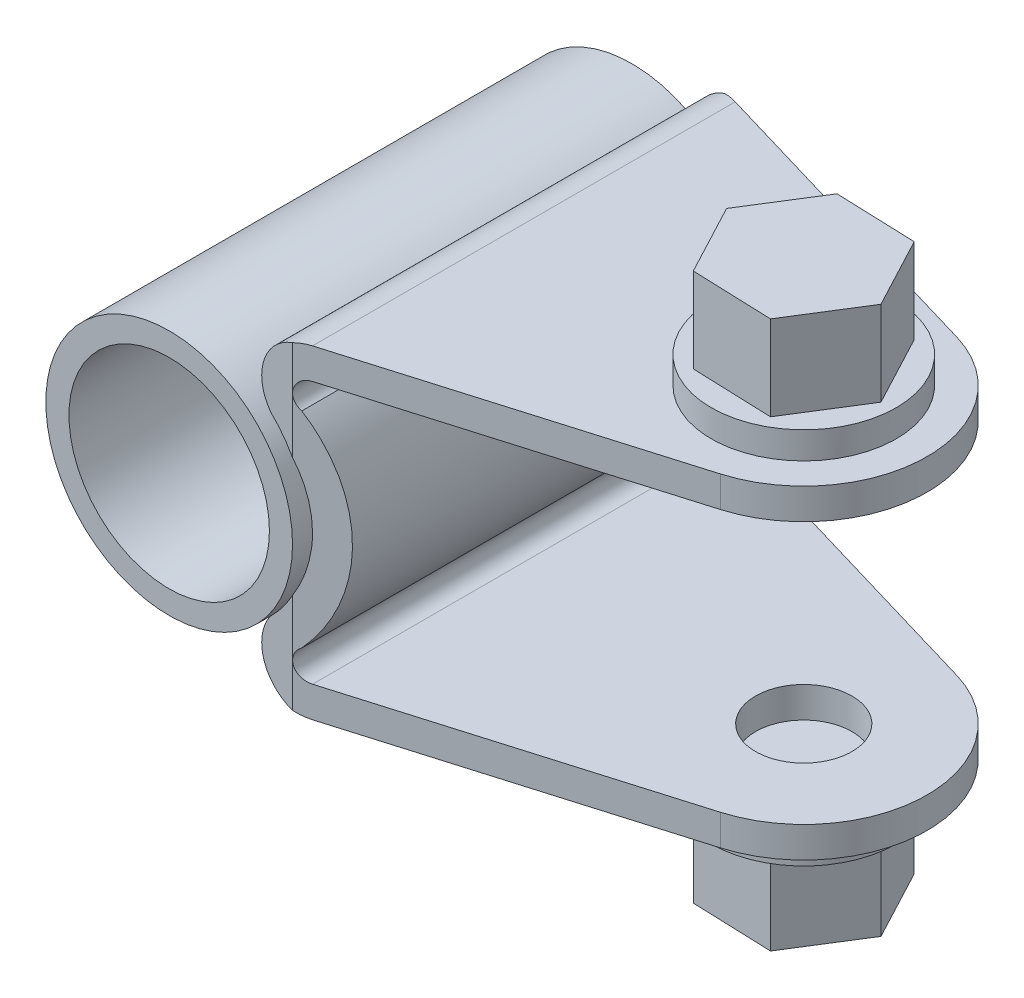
ISO-10303-21;
HEADER;
FILE_DESCRIPTION(('STEP AP214'),'2;1');
FILE_NAME('part.step','',(''),(''),'','','');
FILE_SCHEMA(('AUTOMOTIVE_DESIGN { 1 0 10303 214 1 1 1 1 }'));
ENDSEC;
DATA;
#1=APPLICATION_CONTEXT('core data for automotive mechanical design processes');
#2=APPLICATION_PROTOCOL_DEFINITION('international standard','automotive_design',2000,#1);
#3=PRODUCT_CONTEXT('',#1,'mechanical');
#4=PRODUCT('Part','Part','',(#3));
#5=PRODUCT_RELATED_PRODUCT_CATEGORY('part','',(#4));
#6=PRODUCT_DEFINITION_FORMATION('','',#4);
#7=PRODUCT_DEFINITION_CONTEXT('part definition',#1,'design');
#8=PRODUCT_DEFINITION('design','',#6,#7);
#9=PRODUCT_DEFINITION_SHAPE('','',#8);
#10=(LENGTH_UNIT() NAMED_UNIT(*) SI_UNIT(.MILLI.,.METRE.));
#11=(NAMED_UNIT(*) PLANE_ANGLE_UNIT() SI_UNIT($,.RADIAN.));
#12=(NAMED_UNIT(*) SI_UNIT($,.STERADIAN.) SOLID_ANGLE_UNIT());
#13=UNCERTAINTY_MEASURE_WITH_UNIT(LENGTH_MEASURE(1.E-05),#10,'distance_accuracy_value','');
#14=(GEOMETRIC_REPRESENTATION_CONTEXT(3) GLOBAL_UNCERTAINTY_ASSIGNED_CONTEXT((#13)) GLOBAL_UNIT_ASSIGNED_CONTEXT((#10,
#11,#12)) REPRESENTATION_CONTEXT('',''));
#15=CARTESIAN_POINT('',(0.,0.,0.));
#16=DIRECTION('',(0.,0.,1.));
#17=DIRECTION('',(1.,0.,0.));
#18=AXIS2_PLACEMENT_3D('',#15,#16,#17);
#19=CARTESIAN_POINT('',(16055.3670907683,-4383.99790931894,0.));
#20=DIRECTION('',(0.,-1.,0.));
#21=DIRECTION('',(1.,0.,0.));
#22=AXIS2_PLACEMENT_3D('',#19,#20,#21);
#23=PLANE('',#22);
#24=CARTESIAN_POINT('',(16055.3670907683,-4383.99790931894,0.));
#25=DIRECTION('',(0.,-1.,0.));
#26=DIRECTION('',(1.,0.,0.));
#27=AXIS2_PLACEMENT_3D('',#24,#25,#26);
#28=CIRCLE('',#27,12.0000000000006);
#29=CARTESIAN_POINT('',(16067.3670907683,-4383.99790931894,0.));
#30=VERTEX_POINT('',#29);
#31=EDGE_CURVE('E225',#30,#30,#28,.T.);
#32=ORIENTED_EDGE('',*,*,#31,.T.);
#33=EDGE_LOOP('',(#32));
#34=FACE_BOUND('',#33,.T.);
#35=DIRECTION('',(0.46827475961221,0.,0.883582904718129));
#36=VECTOR('',#35,1.);
#37=CARTESIAN_POINT('',(16060.8861098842,-4383.99790931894,-8.80570428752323));
#38=LINE('',#37,#36);
#39=CARTESIAN_POINT('',(16060.8861098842,-4383.99790931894,-8.80570428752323));
#40=VERTEX_POINT('',#39);
#41=CARTESIAN_POINT('',(16065.7525639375,-4383.99790931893,0.376758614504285));
#42=VERTEX_POINT('',#41);
#43=EDGE_CURVE('E219',#40,#42,#38,.T.);
#44=ORIENTED_EDGE('',*,*,#43,.F.);
#45=DIRECTION('',(0.99934262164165,0.,0.0362536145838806));
#46=VECTOR('',#45,1.);
#47=CARTESIAN_POINT('',(16050.5006367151,-4383.99790931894,-9.18246290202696));
#48=LINE('',#47,#46);
#49=CARTESIAN_POINT('',(16050.5006367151,-4383.99790931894,-9.18246290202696));
#50=VERTEX_POINT('',#49);
#51=EDGE_CURVE('E230',#50,#40,#48,.T.);
#52=ORIENTED_EDGE('',*,*,#51,.F.);
#53=DIRECTION('',(0.531067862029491,0.,-0.847329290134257));
#54=VECTOR('',#53,1.);
#55=CARTESIAN_POINT('',(16044.9816175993,-4383.99790931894,-0.376758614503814));
#56=LINE('',#55,#54);
#57=CARTESIAN_POINT('',(16044.9816175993,-4383.99790931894,-0.376758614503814));
#58=VERTEX_POINT('',#57);
#59=EDGE_CURVE('E247',#58,#50,#56,.T.);
#60=ORIENTED_EDGE('',*,*,#59,.F.);
#61=DIRECTION('',(-0.468274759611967,0.,-0.883582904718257));
#62=VECTOR('',#61,1.);
#63=CARTESIAN_POINT('',(16049.8480716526,-4383.99790931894,8.80570428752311));
#64=LINE('',#63,#62);
#65=CARTESIAN_POINT('',(16049.8480716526,-4383.99790931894,8.80570428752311));
#66=VERTEX_POINT('',#65);
#67=EDGE_CURVE('E245',#66,#58,#64,.T.);
#68=ORIENTED_EDGE('',*,*,#67,.F.);
#69=DIRECTION('',(-0.99934262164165,0.,-0.0362536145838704));
#70=VECTOR('',#69,1.);
#71=CARTESIAN_POINT('',(16060.2335448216,-4383.99790931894,9.18246290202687));
#72=LINE('',#71,#70);
#73=CARTESIAN_POINT('',(16060.2335448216,-4383.99790931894,9.18246290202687));
#74=VERTEX_POINT('',#73);
#75=EDGE_CURVE('E241',#74,#66,#72,.T.);
#76=ORIENTED_EDGE('',*,*,#75,.F.);
#77=DIRECTION('',(-0.531067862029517,0.,0.847329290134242));
#78=VECTOR('',#77,1.);
#79=CARTESIAN_POINT('',(16065.7525639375,-4383.99790931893,0.376758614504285));
#80=LINE('',#79,#78);
#81=EDGE_CURVE('E239',#42,#74,#80,.T.);
#82=ORIENTED_EDGE('',*,*,#81,.F.);
#83=EDGE_LOOP('',(#44,#52,#60,#68,#76,#82));
#84=FACE_BOUND('',#83,.T.);
#85=ADVANCED_FACE('F16',(#34,#84),#23,.T.);
#86=CARTESIAN_POINT('',(16019.0670907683,-4380.49790931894,30.));
#87=DIRECTION('',(0.,1.,0.));
#88=DIRECTION('',(-1.,0.,0.));
#89=AXIS2_PLACEMENT_3D('',#86,#87,#88);
#90=PLANE('',#89);
#91=DIRECTION('',(-0.959015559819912,0.,-0.283353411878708));
#92=VECTOR('',#91,1.);
#93=CARTESIAN_POINT('',(16034.6674516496,-4380.49790931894,-22.7997482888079));
#94=LINE('',#93,#92);
#95=CARTESIAN_POINT('',(16059.9007453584,-4380.49790931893,-15.3442489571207));
#96=VERTEX_POINT('',#95);
#97=CARTESIAN_POINT('',(16019.0670907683,-4380.49790931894,-27.4090744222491));
#98=VERTEX_POINT('',#97);
#99=EDGE_CURVE('E400',#96,#98,#94,.T.);
#100=ORIENTED_EDGE('',*,*,#99,.F.);
#101=CARTESIAN_POINT('',(16055.3670907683,-4380.49790931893,0.));
#102=DIRECTION('',(0.,1.,0.));
#103=DIRECTION('',(-1.,0.,0.));
#104=AXIS2_PLACEMENT_3D('',#101,#102,#103);
#105=CIRCLE('',#104,16.0000000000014);
#106=CARTESIAN_POINT('',(16059.9007453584,-4380.49790931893,15.34424895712));
#107=VERTEX_POINT('',#106);
#108=EDGE_CURVE('E417',#107,#96,#105,.T.);
#109=ORIENTED_EDGE('',*,*,#108,.F.);
#110=DIRECTION('',(0.959015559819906,0.,-0.283353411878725));
#111=VECTOR('',#110,1.);
#112=CARTESIAN_POINT('',(16018.3630317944,-4380.49790931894,27.6170976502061));
#113=LINE('',#112,#111);
#114=CARTESIAN_POINT('',(16019.0670907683,-4380.49790931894,27.4090744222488));
#115=VERTEX_POINT('',#114);
#116=EDGE_CURVE('E384',#115,#107,#113,.T.);
#117=ORIENTED_EDGE('',*,*,#116,.F.);
#118=DIRECTION('',(0.,0.,-1.));
#119=VECTOR('',#118,1.);
#120=CARTESIAN_POINT('',(16019.0670907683,-4380.49790931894,30.));
#121=LINE('',#120,#119);
#122=EDGE_CURVE('E434',#115,#98,#121,.T.);
#123=ORIENTED_EDGE('',*,*,#122,.T.);
#124=EDGE_LOOP('',(#100,#109,#117,#123));
#125=FACE_BOUND('',#124,.T.);
#126=CARTESIAN_POINT('',(16055.3670907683,-4380.49790931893,0.));
#127=DIRECTION('',(0.,1.,0.));
#128=DIRECTION('',(-1.,0.,0.));
#129=AXIS2_PLACEMENT_3D('',#126,#127,#128);
#130=CIRCLE('',#129,12.0000000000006);
#131=CARTESIAN_POINT('',(16043.3670907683,-4380.49790931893,0.));
#132=VERTEX_POINT('',#131);
#133=EDGE_CURVE('E11',#132,#132,#130,.F.);
#134=ORIENTED_EDGE('',*,*,#133,.F.);
#135=EDGE_LOOP('',(#134));
#136=FACE_BOUND('',#135,.T.);
#137=ADVANCED_FACE('F477',(#125,#136),#90,.F.);
#138=CARTESIAN_POINT('',(16055.3670907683,-4334.99790931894,0.));
#139=DIRECTION('',(0.,1.,0.));
#140=DIRECTION('',(0.,0.,1.));
#141=AXIS2_PLACEMENT_3D('',#138,#139,#140);
#142=PLANE('',#141);
#143=CARTESIAN_POINT('',(16055.3670907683,-4334.99790931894,0.));
#144=DIRECTION('',(0.,1.,0.));
#145=DIRECTION('',(0.,0.,1.));
#146=AXIS2_PLACEMENT_3D('',#143,#144,#145);
#147=CIRCLE('',#146,12.0000000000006);
#148=CARTESIAN_POINT('',(16055.3670907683,-4334.99790931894,12.0000000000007));
#149=VERTEX_POINT('',#148);
#150=EDGE_CURVE('E312',#149,#149,#147,.T.);
#151=ORIENTED_EDGE('',*,*,#150,.T.);
#152=EDGE_LOOP('',(#151));
#153=FACE_BOUND('',#152,.T.);
#154=DIRECTION('',(-0.531067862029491,0.,0.847329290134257));
#155=VECTOR('',#154,1.);
#156=CARTESIAN_POINT('',(16050.5006367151,-4334.99790931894,-9.18246290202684));
#157=LINE('',#156,#155);
#158=CARTESIAN_POINT('',(16050.5006367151,-4334.99790931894,-9.18246290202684));
#159=VERTEX_POINT('',#158);
#160=CARTESIAN_POINT('',(16044.9816175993,-4334.99790931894,-0.376758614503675));
#161=VERTEX_POINT('',#160);
#162=EDGE_CURVE('E274',#159,#161,#157,.T.);
#163=ORIENTED_EDGE('',*,*,#162,.F.);
#164=DIRECTION('',(-0.99934262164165,0.,-0.0362536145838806));
#165=VECTOR('',#164,1.);
#166=CARTESIAN_POINT('',(16060.8861098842,-4334.99790931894,-8.80570428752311));
#167=LINE('',#166,#165);
#168=CARTESIAN_POINT('',(16060.8861098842,-4334.99790931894,-8.80570428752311));
#169=VERTEX_POINT('',#168);
#170=EDGE_CURVE('E271',#169,#159,#167,.T.);
#171=ORIENTED_EDGE('',*,*,#170,.F.);
#172=DIRECTION('',(-0.46827475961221,0.,-0.883582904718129));
#173=VECTOR('',#172,1.);
#174=CARTESIAN_POINT('',(16065.7525639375,-4334.99790931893,0.376758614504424));
#175=LINE('',#174,#173);
#176=CARTESIAN_POINT('',(16065.7525639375,-4334.99790931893,0.376758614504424));
#177=VERTEX_POINT('',#176);
#178=EDGE_CURVE('E282',#177,#169,#175,.T.);
#179=ORIENTED_EDGE('',*,*,#178,.F.);
#180=DIRECTION('',(0.531067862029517,0.,-0.847329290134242));
#181=VECTOR('',#180,1.);
#182=CARTESIAN_POINT('',(16060.2335448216,-4334.99790931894,9.18246290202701));
#183=LINE('',#182,#181);
#184=CARTESIAN_POINT('',(16060.2335448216,-4334.99790931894,9.18246290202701));
#185=VERTEX_POINT('',#184);
#186=EDGE_CURVE('E280',#185,#177,#183,.T.);
#187=ORIENTED_EDGE('',*,*,#186,.F.);
#188=DIRECTION('',(0.99934262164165,0.,0.0362536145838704));
#189=VECTOR('',#188,1.);
#190=CARTESIAN_POINT('',(16049.8480716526,-4334.99790931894,8.80570428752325));
#191=LINE('',#190,#189);
#192=CARTESIAN_POINT('',(16049.8480716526,-4334.99790931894,8.80570428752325));
#193=VERTEX_POINT('',#192);
#194=EDGE_CURVE('E278',#193,#185,#191,.T.);
#195=ORIENTED_EDGE('',*,*,#194,.F.);
#196=DIRECTION('',(0.468274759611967,0.,0.883582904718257));
#197=VECTOR('',#196,1.);
#198=CARTESIAN_POINT('',(16044.9816175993,-4334.99790931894,-0.376758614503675));
#199=LINE('',#198,#197);
#200=EDGE_CURVE('E276',#161,#193,#199,.T.);
#201=ORIENTED_EDGE('',*,*,#200,.F.);
#202=EDGE_LOOP('',(#163,#171,#179,#187,#195,#201));
#203=FACE_BOUND('',#202,.T.);
#204=ADVANCED_FACE('F466',(#153,#203),#142,.T.);
#205=CARTESIAN_POINT('',(16071.3670907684,-4338.49790931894,30.));
#206=DIRECTION('',(0.,-1.,0.));
#207=DIRECTION('',(0.,0.,-1.));
#208=AXIS2_PLACEMENT_3D('',#205,#206,#207);
#209=PLANE('',#208);
#210=DIRECTION('',(-0.959015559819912,0.,-0.283353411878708));
#211=VECTOR('',#210,1.);
#212=CARTESIAN_POINT('',(16017.0670907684,-4338.49790931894,-27.9999999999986));
#213=LINE('',#212,#211);
#214=CARTESIAN_POINT('',(16059.9007453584,-4338.49790931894,-15.3442489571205));
#215=VERTEX_POINT('',#214);
#216=CARTESIAN_POINT('',(16019.0670907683,-4338.49790931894,-27.4090744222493));
#217=VERTEX_POINT('',#216);
#218=EDGE_CURVE('E354',#215,#217,#213,.T.);
#219=ORIENTED_EDGE('',*,*,#218,.T.);
#220=DIRECTION('',(0.,0.,-1.));
#221=VECTOR('',#220,1.);
#222=CARTESIAN_POINT('',(16019.0670907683,-4338.49790931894,30.));
#223=LINE('',#222,#221);
#224=CARTESIAN_POINT('',(16019.0670907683,-4338.49790931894,27.4090744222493));
#225=VERTEX_POINT('',#224);
#226=EDGE_CURVE('E437',#225,#217,#223,.T.);
#227=ORIENTED_EDGE('',*,*,#226,.F.);
#228=DIRECTION('',(0.959015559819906,0.,-0.283353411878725));
#229=VECTOR('',#228,1.);
#230=CARTESIAN_POINT('',(16017.0670907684,-4338.49790931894,27.9999999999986));
#231=LINE('',#230,#229);
#232=CARTESIAN_POINT('',(16059.9007453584,-4338.49790931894,15.3442489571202));
#233=VERTEX_POINT('',#232);
#234=EDGE_CURVE('E349',#225,#233,#231,.T.);
#235=ORIENTED_EDGE('',*,*,#234,.T.);
#236=CARTESIAN_POINT('',(16055.3670907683,-4338.49790931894,0.));
#237=DIRECTION('',(0.,1.,0.));
#238=DIRECTION('',(0.,0.,1.));
#239=AXIS2_PLACEMENT_3D('',#236,#237,#238);
#240=CIRCLE('',#239,16.0000000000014);
#241=EDGE_CURVE('E352',#233,#215,#240,.T.);
#242=ORIENTED_EDGE('',*,*,#241,.T.);
#243=EDGE_LOOP('',(#219,#227,#235,#242));
#244=FACE_BOUND('',#243,.T.);
#245=CARTESIAN_POINT('',(16055.3670907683,-4338.49790931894,0.));
#246=DIRECTION('',(0.,-1.,0.));
#247=DIRECTION('',(0.,0.,-1.));
#248=AXIS2_PLACEMENT_3D('',#245,#246,#247);
#249=CIRCLE('',#248,12.0000000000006);
#250=CARTESIAN_POINT('',(16055.3670907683,-4338.49790931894,-12.0000000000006));
#251=VERTEX_POINT('',#250);
#252=EDGE_CURVE('E24',#251,#251,#249,.F.);
#253=ORIENTED_EDGE('',*,*,#252,.F.);
#254=EDGE_LOOP('',(#253));
#255=FACE_BOUND('',#254,.T.);
#256=ADVANCED_FACE('F463',(#244,#255),#209,.F.);
#257=CARTESIAN_POINT('',(16019.0670907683,-4344.49790931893,30.));
#258=DIRECTION('',(0.,0.,-1.));
#259=DIRECTION('',(-1.,0.,0.));
#260=AXIS2_PLACEMENT_3D('',#257,#258,#259);
#261=CYLINDRICAL_SURFACE('',#260,6.);
#262=DIRECTION('',(0.,0.,-1.));
#263=VECTOR('',#262,1.);
#264=CARTESIAN_POINT('',(16014.1989782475,-4348.00525596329,0.));
#265=LINE('',#264,#263);
#266=CARTESIAN_POINT('',(16014.1989782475,-4348.00525596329,27.9999999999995));
#267=VERTEX_POINT('',#266);
#268=CARTESIAN_POINT('',(16014.1989782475,-4348.00525596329,-27.9999999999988));
#269=VERTEX_POINT('',#268);
#270=EDGE_CURVE('E338',#267,#269,#265,.T.);
#271=ORIENTED_EDGE('',*,*,#270,.F.);
#272=CARTESIAN_POINT('',(16019.0670907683,-4344.49790931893,27.9999999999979));
#273=DIRECTION('',(3.38271077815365E-13,0.,1.));
#274=DIRECTION('',(1.,0.,-3.38271077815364E-13));
#275=AXIS2_PLACEMENT_3D('',#272,#273,#274);
#276=CIRCLE('',#275,6.);
#277=CARTESIAN_POINT('',(16017.0670907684,-4338.84105506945,27.9999999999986));
#278=VERTEX_POINT('',#277);
#279=EDGE_CURVE('E414',#278,#267,#276,.T.);
#280=ORIENTED_EDGE('',*,*,#279,.F.);
#281=CARTESIAN_POINT('',(16019.0670907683,-4344.49790931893,27.4090744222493));
#282=DIRECTION('',(0.283353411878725,0.,0.959015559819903));
#283=DIRECTION('',(0.959015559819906,0.,-0.283353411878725));
#284=AXIS2_PLACEMENT_3D('',#281,#282,#283);
#285=ELLIPSE('',#284,6.25641569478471,6.);
#286=EDGE_CURVE('E388',#225,#278,#285,.T.);
#287=ORIENTED_EDGE('',*,*,#286,.F.);
#288=ORIENTED_EDGE('',*,*,#226,.T.);
#289=CARTESIAN_POINT('',(16019.0670907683,-4344.49790931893,-27.4090744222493));
#290=DIRECTION('',(0.283353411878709,0.,-0.959015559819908));
#291=DIRECTION('',(-0.959015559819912,0.,-0.283353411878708));
#292=AXIS2_PLACEMENT_3D('',#289,#290,#291);
#293=ELLIPSE('',#292,6.25641569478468,6.);
#294=CARTESIAN_POINT('',(16017.0670907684,-4338.84105506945,-27.9999999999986));
#295=VERTEX_POINT('',#294);
#296=EDGE_CURVE('E405',#295,#217,#293,.T.);
#297=ORIENTED_EDGE('',*,*,#296,.F.);
#298=CARTESIAN_POINT('',(16019.0670907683,-4344.49790931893,-27.9999999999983));
#299=DIRECTION('',(1.0581813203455E-13,0.,-1.));
#300=DIRECTION('',(-1.,0.,-1.0581813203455E-13));
#301=AXIS2_PLACEMENT_3D('',#298,#299,#300);
#302=CIRCLE('',#301,6.);
#303=EDGE_CURVE('E410',#269,#295,#302,.T.);
#304=ORIENTED_EDGE('',*,*,#303,.F.);
#305=EDGE_LOOP('',(#271,#280,#287,#288,#297,#304));
#306=FACE_BOUND('',#305,.T.);
#307=ADVANCED_FACE('F465',(#306),#261,.T.);
#308=CARTESIAN_POINT('',(16019.0670907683,-4374.49790931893,30.));
#309=DIRECTION('',(0.,0.,-1.));
#310=DIRECTION('',(-1.,0.,0.));
#311=AXIS2_PLACEMENT_3D('',#308,#309,#310);
#312=CYLINDRICAL_SURFACE('',#311,6.);
#313=DIRECTION('',(0.,0.,-1.));
#314=VECTOR('',#313,1.);
#315=CARTESIAN_POINT('',(16014.1989782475,-4370.99056267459,0.));
#316=LINE('',#315,#314);
#317=CARTESIAN_POINT('',(16014.1989782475,-4370.99056267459,-27.9999999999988));
#318=VERTEX_POINT('',#317);
#319=CARTESIAN_POINT('',(16014.1989782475,-4370.99056267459,27.9999999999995));
#320=VERTEX_POINT('',#319);
#321=EDGE_CURVE('E336',#318,#320,#316,.F.);
#322=ORIENTED_EDGE('',*,*,#321,.F.);
#323=CARTESIAN_POINT('',(16019.0670907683,-4374.49790931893,-27.9999999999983));
#324=DIRECTION('',(1.0581813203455E-13,0.,-1.));
#325=DIRECTION('',(-1.,0.,-1.0581813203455E-13));
#326=AXIS2_PLACEMENT_3D('',#323,#324,#325);
#327=CIRCLE('',#326,6.);
#328=CARTESIAN_POINT('',(16017.0670907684,-4380.15476356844,-27.9999999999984));
#329=VERTEX_POINT('',#328);
#330=EDGE_CURVE('E407',#329,#318,#327,.T.);
#331=ORIENTED_EDGE('',*,*,#330,.F.);
#332=CARTESIAN_POINT('',(16019.0670907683,-4374.49790931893,-27.4090744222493));
#333=DIRECTION('',(0.283353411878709,0.,-0.959015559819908));
#334=DIRECTION('',(-0.959015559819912,0.,-0.283353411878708));
#335=AXIS2_PLACEMENT_3D('',#332,#333,#334);
#336=ELLIPSE('',#335,6.25641569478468,6.);
#337=EDGE_CURVE('E402',#98,#329,#336,.T.);
#338=ORIENTED_EDGE('',*,*,#337,.F.);
#339=ORIENTED_EDGE('',*,*,#122,.F.);
#340=CARTESIAN_POINT('',(16019.0670907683,-4374.49790931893,27.4090744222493));
#341=DIRECTION('',(0.283353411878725,0.,0.959015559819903));
#342=DIRECTION('',(0.959015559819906,0.,-0.283353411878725));
#343=AXIS2_PLACEMENT_3D('',#340,#341,#342);
#344=ELLIPSE('',#343,6.25641569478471,6.);
#345=CARTESIAN_POINT('',(16017.0670907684,-4380.15476356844,27.9999999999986));
#346=VERTEX_POINT('',#345);
#347=EDGE_CURVE('E386',#346,#115,#344,.T.);
#348=ORIENTED_EDGE('',*,*,#347,.F.);
#349=CARTESIAN_POINT('',(16019.0670907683,-4374.49790931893,27.9999999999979));
#350=DIRECTION('',(3.38271077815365E-13,0.,1.));
#351=DIRECTION('',(1.,0.,-3.38271077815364E-13));
#352=AXIS2_PLACEMENT_3D('',#349,#350,#351);
#353=CIRCLE('',#352,6.);
#354=EDGE_CURVE('E412',#320,#346,#353,.T.);
#355=ORIENTED_EDGE('',*,*,#354,.F.);
#356=EDGE_LOOP('',(#322,#331,#338,#339,#348,#355));
#357=FACE_BOUND('',#356,.T.);
#358=ADVANCED_FACE('F474',(#357),#312,.T.);
#359=CARTESIAN_POINT('',(16013.0670907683,-4398.49790931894,28.));
#360=DIRECTION('',(3.38271077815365E-13,0.,1.));
#361=DIRECTION('',(1.,0.,-3.38271077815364E-13));
#362=AXIS2_PLACEMENT_3D('',#359,#360,#361);
#363=PLANE('',#362);
#364=ORIENTED_EDGE('',*,*,#279,.T.);
#365=CARTESIAN_POINT('',(16003.0670907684,-4359.49790931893,28.0000000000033));
#366=DIRECTION('',(3.38271077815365E-13,0.,1.));
#367=DIRECTION('',(1.,0.,-3.38271077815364E-13));
#368=AXIS2_PLACEMENT_3D('',#365,#366,#367);
#369=CIRCLE('',#368,15.9999999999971);
#370=CARTESIAN_POINT('',(16017.0670907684,-4351.75194262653,27.9999999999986));
#371=VERTEX_POINT('',#370);
#372=EDGE_CURVE('E333',#267,#371,#369,.F.);
#373=ORIENTED_EDGE('',*,*,#372,.T.);
#374=DIRECTION('',(0.,1.,0.));
#375=VECTOR('',#374,1.);
#376=CARTESIAN_POINT('',(16017.0670907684,-4398.49790931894,27.9999999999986));
#377=LINE('',#376,#375);
#378=CARTESIAN_POINT('',(16017.0670907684,-4344.49790931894,27.9999999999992));
#379=VERTEX_POINT('',#378);
#380=EDGE_CURVE('E373',#371,#379,#377,.T.);
#381=ORIENTED_EDGE('',*,*,#380,.T.);
#382=EDGE_CURVE('E357',#379,#278,#377,.T.);
#383=ORIENTED_EDGE('',*,*,#382,.T.);
#384=EDGE_LOOP('',(#364,#373,#381,#383));
#385=FACE_BOUND('',#384,.T.);
#386=ADVANCED_FACE('F571',(#385),#363,.T.);
#387=CARTESIAN_POINT('',(16017.0670907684,-4374.49790931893,27.9999999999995));
#388=VERTEX_POINT('',#387);
#389=CARTESIAN_POINT('',(16017.0670907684,-4367.24387601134,27.9999999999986));
#390=VERTEX_POINT('',#389);
#391=EDGE_CURVE('E649',#388,#390,#377,.T.);
#392=ORIENTED_EDGE('',*,*,#391,.T.);
#393=CARTESIAN_POINT('',(16003.0670907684,-4359.49790931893,28.0000000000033));
#394=DIRECTION('',(3.38271077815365E-13,0.,1.));
#395=DIRECTION('',(1.,0.,-3.38271077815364E-13));
#396=AXIS2_PLACEMENT_3D('',#393,#394,#395);
#397=CIRCLE('',#396,15.9999999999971);
#398=EDGE_CURVE('E330',#390,#320,#397,.F.);
#399=ORIENTED_EDGE('',*,*,#398,.T.);
#400=ORIENTED_EDGE('',*,*,#354,.T.);
#401=EDGE_CURVE('E370',#346,#388,#377,.T.);
#402=ORIENTED_EDGE('',*,*,#401,.T.);
#403=EDGE_LOOP('',(#392,#399,#400,#402));
#404=FACE_BOUND('',#403,.T.);
#405=ADVANCED_FACE('F552',(#404),#363,.T.);
#406=CARTESIAN_POINT('',(16013.0670907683,-4398.49790931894,-27.9999999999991));
#407=DIRECTION('',(1.0581813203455E-13,0.,-1.));
#408=DIRECTION('',(-1.,0.,-1.0581813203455E-13));
#409=AXIS2_PLACEMENT_3D('',#406,#407,#408);
#410=PLANE('',#409);
#411=DIRECTION('',(0.,1.,0.));
#412=VECTOR('',#411,1.);
#413=CARTESIAN_POINT('',(16017.0670907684,-4398.49790931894,-27.9999999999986));
#414=LINE('',#413,#412);
#415=CARTESIAN_POINT('',(16017.0670907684,-4351.75194262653,-27.9999999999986));
#416=VERTEX_POINT('',#415);
#417=CARTESIAN_POINT('',(16017.0670907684,-4344.49790931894,-27.9999999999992));
#418=VERTEX_POINT('',#417);
#419=EDGE_CURVE('E361',#416,#418,#414,.T.);
#420=ORIENTED_EDGE('',*,*,#419,.F.);
#421=CARTESIAN_POINT('',(16003.0670907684,-4359.49790931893,-28.));
#422=DIRECTION('',(1.0581813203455E-13,0.,-1.));
#423=DIRECTION('',(-1.,0.,-1.0581813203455E-13));
#424=AXIS2_PLACEMENT_3D('',#421,#422,#423);
#425=CIRCLE('',#424,15.9999999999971);
#426=EDGE_CURVE('E343',#416,#269,#425,.F.);
#427=ORIENTED_EDGE('',*,*,#426,.T.);
#428=ORIENTED_EDGE('',*,*,#303,.T.);
#429=EDGE_CURVE('E358',#418,#295,#414,.T.);
#430=ORIENTED_EDGE('',*,*,#429,.F.);
#431=EDGE_LOOP('',(#420,#427,#428,#430));
#432=FACE_BOUND('',#431,.T.);
#433=ADVANCED_FACE('F548',(#432),#410,.T.);
#434=ORIENTED_EDGE('',*,*,#330,.T.);
#435=CARTESIAN_POINT('',(16003.0670907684,-4359.49790931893,-28.));
#436=DIRECTION('',(1.0581813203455E-13,0.,-1.));
#437=DIRECTION('',(-1.,0.,-1.0581813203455E-13));
#438=AXIS2_PLACEMENT_3D('',#435,#436,#437);
#439=CIRCLE('',#438,15.9999999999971);
#440=CARTESIAN_POINT('',(16017.0670907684,-4367.24387601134,-27.9999999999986));
#441=VERTEX_POINT('',#440);
#442=EDGE_CURVE('E340',#318,#441,#439,.F.);
#443=ORIENTED_EDGE('',*,*,#442,.T.);
#444=CARTESIAN_POINT('',(16017.0670907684,-4374.49790931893,-27.9999999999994));
#445=VERTEX_POINT('',#444);
#446=EDGE_CURVE('E601',#445,#441,#414,.T.);
#447=ORIENTED_EDGE('',*,*,#446,.F.);
#448=EDGE_CURVE('E363',#329,#445,#414,.T.);
#449=ORIENTED_EDGE('',*,*,#448,.F.);
#450=EDGE_LOOP('',(#434,#443,#447,#449));
#451=FACE_BOUND('',#450,.T.);
#452=ADVANCED_FACE('F551',(#451),#410,.T.);
#453=CARTESIAN_POINT('',(16017.0670907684,-4398.49790931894,-27.9999999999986));
#454=DIRECTION('',(0.283353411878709,0.,-0.959015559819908));
#455=DIRECTION('',(-0.959015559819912,0.,-0.283353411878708));
#456=AXIS2_PLACEMENT_3D('',#453,#454,#455);
#457=PLANE('',#456);
#458=ORIENTED_EDGE('',*,*,#446,.T.);
#459=CARTESIAN_POINT('',(16003.0670907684,-4359.49790931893,-32.1364790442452));
#460=DIRECTION('',(0.283353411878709,0.,-0.959015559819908));
#461=DIRECTION('',(-0.959015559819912,0.,-0.283353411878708));
#462=AXIS2_PLACEMENT_3D('',#459,#460,#461);
#463=ELLIPSE('',#462,16.6837751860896,15.9999999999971);
#464=EDGE_CURVE('E346',#441,#416,#463,.F.);
#465=ORIENTED_EDGE('',*,*,#464,.T.);
#466=ORIENTED_EDGE('',*,*,#419,.T.);
#467=CARTESIAN_POINT('',(16019.0670907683,-4344.49790931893,-27.4090744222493));
#468=DIRECTION('',(0.283353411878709,0.,-0.959015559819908));
#469=DIRECTION('',(-0.959015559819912,0.,-0.283353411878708));
#470=AXIS2_PLACEMENT_3D('',#467,#468,#469);
#471=ELLIPSE('',#470,2.08547189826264,2.00000000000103);
#472=CARTESIAN_POINT('',(16017.9917664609,-4346.18423005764,-27.7267927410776));
#473=VERTEX_POINT('',#472);
#474=EDGE_CURVE('E395',#418,#473,#471,.F.);
#475=ORIENTED_EDGE('',*,*,#474,.T.);
#476=CARTESIAN_POINT('',(16003.0670907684,-4359.49790931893,-32.1364790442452));
#477=DIRECTION('',(0.283353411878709,0.,-0.959015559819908));
#478=DIRECTION('',(-0.959015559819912,0.,-0.283353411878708));
#479=AXIS2_PLACEMENT_3D('',#476,#477,#478);
#480=ELLIPSE('',#479,20.8547189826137,19.9999999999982);
#481=CARTESIAN_POINT('',(16017.9917664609,-4372.81158858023,-27.7267927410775));
#482=VERTEX_POINT('',#481);
#483=EDGE_CURVE('E393',#473,#482,#480,.T.);
#484=ORIENTED_EDGE('',*,*,#483,.T.);
#485=CARTESIAN_POINT('',(16019.0670907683,-4374.49790931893,-27.4090744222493));
#486=DIRECTION('',(0.283353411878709,0.,-0.959015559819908));
#487=DIRECTION('',(-0.959015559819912,0.,-0.283353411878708));
#488=AXIS2_PLACEMENT_3D('',#485,#486,#487);
#489=ELLIPSE('',#488,2.08547189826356,2.00000000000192);
#490=EDGE_CURVE('E451',#482,#445,#489,.F.);
#491=ORIENTED_EDGE('',*,*,#490,.T.);
#492=EDGE_LOOP('',(#458,#465,#466,#475,#484,#491));
#493=FACE_BOUND('',#492,.T.);
#494=ADVANCED_FACE('F560',(#493),#457,.T.);
#495=CARTESIAN_POINT('',(16017.0670907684,-4398.49790931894,27.9999999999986));
#496=DIRECTION('',(0.283353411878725,0.,0.959015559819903));
#497=DIRECTION('',(0.959015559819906,0.,-0.283353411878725));
#498=AXIS2_PLACEMENT_3D('',#495,#496,#497);
#499=PLANE('',#498);
#500=ORIENTED_EDGE('',*,*,#380,.F.);
#501=CARTESIAN_POINT('',(16003.0670907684,-4359.49790931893,32.1364790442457));
#502=DIRECTION('',(0.283353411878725,0.,0.959015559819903));
#503=DIRECTION('',(0.959015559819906,0.,-0.283353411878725));
#504=AXIS2_PLACEMENT_3D('',#501,#502,#503);
#505=ELLIPSE('',#504,16.6837751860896,15.9999999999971);
#506=EDGE_CURVE('E456',#371,#390,#505,.F.);
#507=ORIENTED_EDGE('',*,*,#506,.T.);
#508=ORIENTED_EDGE('',*,*,#391,.F.);
#509=CARTESIAN_POINT('',(16019.0670907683,-4374.49790931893,27.4090744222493));
#510=DIRECTION('',(0.283353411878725,0.,0.959015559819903));
#511=DIRECTION('',(0.959015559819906,0.,-0.283353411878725));
#512=AXIS2_PLACEMENT_3D('',#509,#510,#511);
#513=ELLIPSE('',#512,2.08547189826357,2.00000000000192);
#514=CARTESIAN_POINT('',(16017.9917664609,-4372.81158858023,27.7267927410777));
#515=VERTEX_POINT('',#514);
#516=EDGE_CURVE('E450',#388,#515,#513,.F.);
#517=ORIENTED_EDGE('',*,*,#516,.T.);
#518=CARTESIAN_POINT('',(16003.0670907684,-4359.49790931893,32.1364790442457));
#519=DIRECTION('',(0.283353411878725,0.,0.959015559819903));
#520=DIRECTION('',(0.959015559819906,0.,-0.283353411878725));
#521=AXIS2_PLACEMENT_3D('',#518,#519,#520);
#522=ELLIPSE('',#521,20.8547189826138,19.9999999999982);
#523=CARTESIAN_POINT('',(16017.9917664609,-4346.18423005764,27.7267927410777));
#524=VERTEX_POINT('',#523);
#525=EDGE_CURVE('E376',#515,#524,#522,.T.);
#526=ORIENTED_EDGE('',*,*,#525,.T.);
#527=CARTESIAN_POINT('',(16019.0670907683,-4344.49790931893,27.4090744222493));
#528=DIRECTION('',(0.283353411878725,0.,0.959015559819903));
#529=DIRECTION('',(0.959015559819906,0.,-0.283353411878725));
#530=AXIS2_PLACEMENT_3D('',#527,#528,#529);
#531=ELLIPSE('',#530,2.08547189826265,2.00000000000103);
#532=EDGE_CURVE('E378',#524,#379,#531,.F.);
#533=ORIENTED_EDGE('',*,*,#532,.T.);
#534=EDGE_LOOP('',(#500,#507,#508,#517,#526,#533));
#535=FACE_BOUND('',#534,.T.);
#536=ADVANCED_FACE('F570',(#535),#499,.T.);
#537=CARTESIAN_POINT('',(16003.0670907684,-4359.49790931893,30.));
#538=DIRECTION('',(0.,0.,-1.));
#539=DIRECTION('',(-1.,0.,0.));
#540=AXIS2_PLACEMENT_3D('',#537,#538,#539);
#541=CYLINDRICAL_SURFACE('',#540,19.9999999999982);
#542=ORIENTED_EDGE('',*,*,#483,.F.);
#543=DIRECTION('',(0.,0.,-1.));
#544=VECTOR('',#543,1.);
#545=CARTESIAN_POINT('',(16017.9917664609,-4346.18423005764,30.));
#546=LINE('',#545,#544);
#547=EDGE_CURVE('E443',#524,#473,#546,.T.);
#548=ORIENTED_EDGE('',*,*,#547,.F.);
#549=ORIENTED_EDGE('',*,*,#525,.F.);
#550=DIRECTION('',(0.,0.,-1.));
#551=VECTOR('',#550,1.);
#552=CARTESIAN_POINT('',(16017.9917664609,-4372.81158858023,30.));
#553=LINE('',#552,#551);
#554=EDGE_CURVE('E428',#515,#482,#553,.T.);
#555=ORIENTED_EDGE('',*,*,#554,.T.);
#556=EDGE_LOOP('',(#542,#548,#549,#555));
#557=FACE_BOUND('',#556,.T.);
#558=ADVANCED_FACE('F18',(#557),#541,.T.);
#559=CARTESIAN_POINT('',(16019.0670907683,-4344.49790931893,30.));
#560=DIRECTION('',(0.,0.,-1.));
#561=DIRECTION('',(-1.,0.,0.));
#562=AXIS2_PLACEMENT_3D('',#559,#560,#561);
#563=CYLINDRICAL_SURFACE('',#562,2.00000000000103);
#564=ORIENTED_EDGE('',*,*,#474,.F.);
#565=CARTESIAN_POINT('',(16019.0670907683,-4342.49790931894,-27.4090744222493));
#566=VERTEX_POINT('',#565);
#567=EDGE_CURVE('E397',#566,#418,#471,.F.);
#568=ORIENTED_EDGE('',*,*,#567,.F.);
#569=DIRECTION('',(0.,0.,-1.));
#570=VECTOR('',#569,1.);
#571=CARTESIAN_POINT('',(16019.0670907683,-4342.49790931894,30.));
#572=LINE('',#571,#570);
#573=CARTESIAN_POINT('',(16019.0670907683,-4342.49790931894,27.4090744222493));
#574=VERTEX_POINT('',#573);
#575=EDGE_CURVE('E440',#574,#566,#572,.T.);
#576=ORIENTED_EDGE('',*,*,#575,.F.);
#577=EDGE_CURVE('E381',#379,#574,#531,.F.);
#578=ORIENTED_EDGE('',*,*,#577,.F.);
#579=ORIENTED_EDGE('',*,*,#532,.F.);
#580=ORIENTED_EDGE('',*,*,#547,.T.);
#581=EDGE_LOOP('',(#564,#568,#576,#578,#579,#580));
#582=FACE_BOUND('',#581,.T.);
#583=ADVANCED_FACE('F617',(#582),#563,.F.);
#584=CARTESIAN_POINT('',(16019.0670907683,-4342.49790931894,30.));
#585=DIRECTION('',(0.,1.,0.));
#586=DIRECTION('',(0.,0.,1.));
#587=AXIS2_PLACEMENT_3D('',#584,#585,#586);
#588=PLANE('',#587);
#589=CARTESIAN_POINT('',(16055.3670907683,-4342.49790931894,0.));
#590=DIRECTION('',(0.,1.,0.));
#591=DIRECTION('',(0.,0.,1.));
#592=AXIS2_PLACEMENT_3D('',#589,#590,#591);
#593=CIRCLE('',#592,6.24999999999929);
#594=CARTESIAN_POINT('',(16055.3670907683,-4342.49790931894,6.24999999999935));
#595=VERTEX_POINT('',#594);
#596=EDGE_CURVE('E425',#595,#595,#593,.T.);
#597=ORIENTED_EDGE('',*,*,#596,.T.);
#598=EDGE_LOOP('',(#597));
#599=FACE_BOUND('',#598,.T.);
#600=DIRECTION('',(-0.959015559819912,0.,-0.283353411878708));
#601=VECTOR('',#600,1.);
#602=CARTESIAN_POINT('',(16034.6674516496,-4342.49790931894,-22.7997482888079));
#603=LINE('',#602,#601);
#604=CARTESIAN_POINT('',(16059.9007453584,-4342.49790931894,-15.3442489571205));
#605=VERTEX_POINT('',#604);
#606=EDGE_CURVE('E398',#605,#566,#603,.T.);
#607=ORIENTED_EDGE('',*,*,#606,.F.);
#608=CARTESIAN_POINT('',(16055.3670907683,-4342.49790931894,0.));
#609=DIRECTION('',(0.,1.,0.));
#610=DIRECTION('',(0.,0.,1.));
#611=AXIS2_PLACEMENT_3D('',#608,#609,#610);
#612=CIRCLE('',#611,16.0000000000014);
#613=CARTESIAN_POINT('',(16059.9007453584,-4342.49790931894,15.3442489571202));
#614=VERTEX_POINT('',#613);
#615=EDGE_CURVE('E419',#614,#605,#612,.T.);
#616=ORIENTED_EDGE('',*,*,#615,.F.);
#617=DIRECTION('',(0.959015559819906,0.,-0.283353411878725));
#618=VECTOR('',#617,1.);
#619=CARTESIAN_POINT('',(16018.3630317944,-4342.49790931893,27.6170976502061));
#620=LINE('',#619,#618);
#621=EDGE_CURVE('E382',#574,#614,#620,.T.);
#622=ORIENTED_EDGE('',*,*,#621,.F.);
#623=ORIENTED_EDGE('',*,*,#575,.T.);
#624=EDGE_LOOP('',(#607,#616,#622,#623));
#625=FACE_BOUND('',#624,.T.);
#626=ADVANCED_FACE('F585',(#599,#625),#588,.F.);
#627=CARTESIAN_POINT('',(16071.3670907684,-4376.49790931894,30.));
#628=DIRECTION('',(0.,-1.,0.));
#629=DIRECTION('',(0.,0.,-1.));
#630=AXIS2_PLACEMENT_3D('',#627,#628,#629);
#631=PLANE('',#630);
#632=CARTESIAN_POINT('',(16055.3670907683,-4376.49790931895,1.38777878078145E-13));
#633=DIRECTION('',(0.,-1.,0.));
#634=DIRECTION('',(0.,0.,-1.));
#635=AXIS2_PLACEMENT_3D('',#632,#633,#634);
#636=CIRCLE('',#635,6.24999999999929);
#637=CARTESIAN_POINT('',(16055.3670907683,-4376.49790931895,-6.24999999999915));
#638=VERTEX_POINT('',#637);
#639=EDGE_CURVE('E421',#638,#638,#636,.T.);
#640=ORIENTED_EDGE('',*,*,#639,.T.);
#641=EDGE_LOOP('',(#640));
#642=FACE_BOUND('',#641,.T.);
#643=DIRECTION('',(0.959015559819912,0.,0.283353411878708));
#644=VECTOR('',#643,1.);
#645=CARTESIAN_POINT('',(16082.7683287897,-4376.49790931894,-8.58772898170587));
#646=LINE('',#645,#644);
#647=CARTESIAN_POINT('',(16019.0670907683,-4376.49790931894,-27.4090744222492));
#648=VERTEX_POINT('',#647);
#649=CARTESIAN_POINT('',(16059.9007453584,-4376.49790931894,-15.3442489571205));
#650=VERTEX_POINT('',#649);
#651=EDGE_CURVE('E390',#648,#650,#646,.T.);
#652=ORIENTED_EDGE('',*,*,#651,.F.);
#653=DIRECTION('',(0.,0.,-1.));
#654=VECTOR('',#653,1.);
#655=CARTESIAN_POINT('',(16019.0670907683,-4376.49790931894,30.));
#656=LINE('',#655,#654);
#657=CARTESIAN_POINT('',(16019.0670907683,-4376.49790931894,27.4090744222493));
#658=VERTEX_POINT('',#657);
#659=EDGE_CURVE('E431',#658,#648,#656,.T.);
#660=ORIENTED_EDGE('',*,*,#659,.F.);
#661=DIRECTION('',(-0.959015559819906,0.,0.283353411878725));
#662=VECTOR('',#661,1.);
#663=CARTESIAN_POINT('',(16066.4639089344,-4376.49790931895,13.4050783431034));
#664=LINE('',#663,#662);
#665=CARTESIAN_POINT('',(16059.9007453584,-4376.49790931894,15.3442489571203));
#666=VERTEX_POINT('',#665);
#667=EDGE_CURVE('E374',#666,#658,#664,.T.);
#668=ORIENTED_EDGE('',*,*,#667,.F.);
#669=CARTESIAN_POINT('',(16055.3670907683,-4376.49790931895,1.38777878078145E-13));
#670=DIRECTION('',(0.,-1.,0.));
#671=DIRECTION('',(0.,0.,-1.));
#672=AXIS2_PLACEMENT_3D('',#669,#670,#671);
#673=CIRCLE('',#672,16.0000000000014);
#674=EDGE_CURVE('E454',#650,#666,#673,.T.);
#675=ORIENTED_EDGE('',*,*,#674,.F.);
#676=EDGE_LOOP('',(#652,#660,#668,#675));
#677=FACE_BOUND('',#676,.T.);
#678=ADVANCED_FACE('F582',(#642,#677),#631,.F.);
#679=CARTESIAN_POINT('',(16019.0670907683,-4374.49790931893,30.));
#680=DIRECTION('',(0.,0.,-1.));
#681=DIRECTION('',(-1.,0.,0.));
#682=AXIS2_PLACEMENT_3D('',#679,#680,#681);
#683=CYLINDRICAL_SURFACE('',#682,2.00000000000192);
#684=EDGE_CURVE('E453',#445,#648,#489,.F.);
#685=ORIENTED_EDGE('',*,*,#684,.F.);
#686=ORIENTED_EDGE('',*,*,#490,.F.);
#687=ORIENTED_EDGE('',*,*,#554,.F.);
#688=ORIENTED_EDGE('',*,*,#516,.F.);
#689=EDGE_CURVE('E446',#658,#388,#513,.F.);
#690=ORIENTED_EDGE('',*,*,#689,.F.);
#691=ORIENTED_EDGE('',*,*,#659,.T.);
#692=EDGE_LOOP('',(#685,#686,#687,#688,#690,#691));
#693=FACE_BOUND('',#692,.T.);
#694=ADVANCED_FACE('F579',(#693),#683,.F.);
#695=CARTESIAN_POINT('',(16055.3670907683,-4398.49790931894,0.));
#696=DIRECTION('',(0.,1.,0.));
#697=DIRECTION('',(0.,0.,1.));
#698=AXIS2_PLACEMENT_3D('',#695,#696,#697);
#699=CYLINDRICAL_SURFACE('',#698,6.24999999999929);
#700=ORIENTED_EDGE('',*,*,#639,.F.);
#701=EDGE_LOOP('',(#700));
#702=FACE_BOUND('',#701,.T.);
#703=CARTESIAN_POINT('',(16055.3670907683,-4380.49790931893,0.));
#704=DIRECTION('',(0.,1.,0.));
#705=DIRECTION('',(-1.,0.,0.));
#706=AXIS2_PLACEMENT_3D('',#703,#704,#705);
#707=CIRCLE('',#706,6.24999999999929);
#708=CARTESIAN_POINT('',(16049.1170907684,-4380.49790931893,0.));
#709=VERTEX_POINT('',#708);
#710=EDGE_CURVE('E422',#709,#709,#707,.T.);
#711=ORIENTED_EDGE('',*,*,#710,.F.);
#712=EDGE_LOOP('',(#711));
#713=FACE_BOUND('',#712,.T.);
#714=ADVANCED_FACE('F577',(#702,#713),#699,.F.);
#715=CARTESIAN_POINT('',(16055.3670907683,-4338.49790931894,0.));
#716=DIRECTION('',(0.,1.,0.));
#717=DIRECTION('',(0.,0.,1.));
#718=AXIS2_PLACEMENT_3D('',#715,#716,#717);
#719=CIRCLE('',#718,6.24999999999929);
#720=CARTESIAN_POINT('',(16055.3670907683,-4338.49790931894,6.24999999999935));
#721=VERTEX_POINT('',#720);
#722=EDGE_CURVE('E315',#721,#721,#719,.F.);
#723=ORIENTED_EDGE('',*,*,#722,.F.);
#724=EDGE_LOOP('',(#723));
#725=FACE_BOUND('',#724,.T.);
#726=ORIENTED_EDGE('',*,*,#596,.F.);
#727=EDGE_LOOP('',(#726));
#728=FACE_BOUND('',#727,.T.);
#729=ADVANCED_FACE('F564',(#725,#728),#699,.F.);
#730=CARTESIAN_POINT('',(16055.3670907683,-4398.49790931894,0.));
#731=DIRECTION('',(0.,1.,0.));
#732=DIRECTION('',(0.,0.,1.));
#733=AXIS2_PLACEMENT_3D('',#730,#731,#732);
#734=CYLINDRICAL_SURFACE('',#733,16.0000000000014);
#735=ORIENTED_EDGE('',*,*,#615,.T.);
#736=DIRECTION('',(0.,1.,0.));
#737=VECTOR('',#736,1.);
#738=CARTESIAN_POINT('',(16059.9007453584,-4398.49790931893,-15.3442489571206));
#739=LINE('',#738,#737);
#740=EDGE_CURVE('E364',#605,#215,#739,.T.);
#741=ORIENTED_EDGE('',*,*,#740,.T.);
#742=ORIENTED_EDGE('',*,*,#241,.F.);
#743=DIRECTION('',(0.,1.,0.));
#744=VECTOR('',#743,1.);
#745=CARTESIAN_POINT('',(16059.9007453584,-4398.49790931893,15.3442489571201));
#746=LINE('',#745,#744);
#747=EDGE_CURVE('E368',#614,#233,#746,.T.);
#748=ORIENTED_EDGE('',*,*,#747,.F.);
#749=EDGE_LOOP('',(#735,#741,#742,#748));
#750=FACE_BOUND('',#749,.T.);
#751=ADVANCED_FACE('F561',(#750),#734,.T.);
#752=ORIENTED_EDGE('',*,*,#108,.T.);
#753=EDGE_CURVE('E362',#96,#650,#739,.T.);
#754=ORIENTED_EDGE('',*,*,#753,.T.);
#755=ORIENTED_EDGE('',*,*,#674,.T.);
#756=EDGE_CURVE('E367',#107,#666,#746,.T.);
#757=ORIENTED_EDGE('',*,*,#756,.F.);
#758=EDGE_LOOP('',(#752,#754,#755,#757));
#759=FACE_BOUND('',#758,.T.);
#760=ADVANCED_FACE('F558',(#759),#734,.T.);
#761=ORIENTED_EDGE('',*,*,#296,.T.);
#762=ORIENTED_EDGE('',*,*,#218,.F.);
#763=ORIENTED_EDGE('',*,*,#740,.F.);
#764=ORIENTED_EDGE('',*,*,#606,.T.);
#765=ORIENTED_EDGE('',*,*,#567,.T.);
#766=ORIENTED_EDGE('',*,*,#429,.T.);
#767=EDGE_LOOP('',(#761,#762,#763,#764,#765,#766));
#768=FACE_BOUND('',#767,.T.);
#769=ADVANCED_FACE('F554',(#768),#457,.T.);
#770=ORIENTED_EDGE('',*,*,#337,.T.);
#771=ORIENTED_EDGE('',*,*,#448,.T.);
#772=ORIENTED_EDGE('',*,*,#684,.T.);
#773=ORIENTED_EDGE('',*,*,#651,.T.);
#774=ORIENTED_EDGE('',*,*,#753,.F.);
#775=ORIENTED_EDGE('',*,*,#99,.T.);
#776=EDGE_LOOP('',(#770,#771,#772,#773,#774,#775));
#777=FACE_BOUND('',#776,.T.);
#778=ADVANCED_FACE('F557',(#777),#457,.T.);
#779=ORIENTED_EDGE('',*,*,#286,.T.);
#780=ORIENTED_EDGE('',*,*,#382,.F.);
#781=ORIENTED_EDGE('',*,*,#577,.T.);
#782=ORIENTED_EDGE('',*,*,#621,.T.);
#783=ORIENTED_EDGE('',*,*,#747,.T.);
#784=ORIENTED_EDGE('',*,*,#234,.F.);
#785=EDGE_LOOP('',(#779,#780,#781,#782,#783,#784));
#786=FACE_BOUND('',#785,.T.);
#787=ADVANCED_FACE('F566',(#786),#499,.T.);
#788=ORIENTED_EDGE('',*,*,#347,.T.);
#789=ORIENTED_EDGE('',*,*,#116,.T.);
#790=ORIENTED_EDGE('',*,*,#756,.T.);
#791=ORIENTED_EDGE('',*,*,#667,.T.);
#792=ORIENTED_EDGE('',*,*,#689,.T.);
#793=ORIENTED_EDGE('',*,*,#401,.F.);
#794=EDGE_LOOP('',(#788,#789,#790,#791,#792,#793));
#795=FACE_BOUND('',#794,.T.);
#796=ADVANCED_FACE('F543',(#795),#499,.T.);
#797=CARTESIAN_POINT('',(16003.0670907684,-4359.49790931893,30.));
#798=DIRECTION('',(0.,0.,1.));
#799=DIRECTION('',(1.,0.,0.));
#800=AXIS2_PLACEMENT_3D('',#797,#798,#799);
#801=PLANE('',#800);
#802=CARTESIAN_POINT('',(16003.0670907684,-4359.49790931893,30.));
#803=DIRECTION('',(0.,0.,1.));
#804=DIRECTION('',(1.,0.,0.));
#805=AXIS2_PLACEMENT_3D('',#802,#803,#804);
#806=CIRCLE('',#805,15.9999999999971);
#807=CARTESIAN_POINT('',(16019.0670907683,-4359.49790931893,30.));
#808=VERTEX_POINT('',#807);
#809=EDGE_CURVE('E327',#808,#808,#806,.T.);
#810=ORIENTED_EDGE('',*,*,#809,.T.);
#811=EDGE_LOOP('',(#810));
#812=FACE_BOUND('',#811,.T.);
#813=CARTESIAN_POINT('',(16003.0670907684,-4359.49790931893,30.));
#814=DIRECTION('',(0.,0.,1.));
#815=DIRECTION('',(1.,0.,0.));
#816=AXIS2_PLACEMENT_3D('',#813,#814,#815);
#817=CIRCLE('',#816,13.0000000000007);
#818=CARTESIAN_POINT('',(16016.0670907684,-4359.49790931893,30.));
#819=VERTEX_POINT('',#818);
#820=EDGE_CURVE('E321',#819,#819,#817,.T.);
#821=ORIENTED_EDGE('',*,*,#820,.F.);
#822=EDGE_LOOP('',(#821));
#823=FACE_BOUND('',#822,.T.);
#824=ADVANCED_FACE('F539',(#812,#823),#801,.T.);
#825=CARTESIAN_POINT('',(16003.0670907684,-4359.49790931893,-30.));
#826=DIRECTION('',(0.,0.,1.));
#827=DIRECTION('',(1.,0.,0.));
#828=AXIS2_PLACEMENT_3D('',#825,#826,#827);
#829=PLANE('',#828);
#830=CARTESIAN_POINT('',(16003.0670907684,-4359.49790931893,-30.));
#831=DIRECTION('',(0.,0.,1.));
#832=DIRECTION('',(1.,0.,0.));
#833=AXIS2_PLACEMENT_3D('',#830,#831,#832);
#834=CIRCLE('',#833,15.9999999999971);
#835=CARTESIAN_POINT('',(16019.0670907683,-4359.49790931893,-30.));
#836=VERTEX_POINT('',#835);
#837=EDGE_CURVE('E324',#836,#836,#834,.T.);
#838=ORIENTED_EDGE('',*,*,#837,.F.);
#839=EDGE_LOOP('',(#838));
#840=FACE_BOUND('',#839,.T.);
#841=CARTESIAN_POINT('',(16003.0670907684,-4359.49790931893,-30.));
#842=DIRECTION('',(0.,0.,1.));
#843=DIRECTION('',(1.,0.,0.));
#844=AXIS2_PLACEMENT_3D('',#841,#842,#843);
#845=CIRCLE('',#844,13.0000000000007);
#846=CARTESIAN_POINT('',(16016.0670907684,-4359.49790931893,-30.));
#847=VERTEX_POINT('',#846);
#848=EDGE_CURVE('E318',#847,#847,#845,.T.);
#849=ORIENTED_EDGE('',*,*,#848,.T.);
#850=EDGE_LOOP('',(#849));
#851=FACE_BOUND('',#850,.T.);
#852=ADVANCED_FACE('F536',(#840,#851),#829,.F.);
#853=CARTESIAN_POINT('',(16003.0670907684,-4359.49790931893,30.));
#854=DIRECTION('',(0.,0.,-1.));
#855=DIRECTION('',(-1.,0.,0.));
#856=AXIS2_PLACEMENT_3D('',#853,#854,#855);
#857=CYLINDRICAL_SURFACE('',#856,15.9999999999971);
#858=ORIENTED_EDGE('',*,*,#464,.F.);
#859=ORIENTED_EDGE('',*,*,#442,.F.);
#860=ORIENTED_EDGE('',*,*,#321,.T.);
#861=ORIENTED_EDGE('',*,*,#398,.F.);
#862=ORIENTED_EDGE('',*,*,#506,.F.);
#863=ORIENTED_EDGE('',*,*,#372,.F.);
#864=ORIENTED_EDGE('',*,*,#270,.T.);
#865=ORIENTED_EDGE('',*,*,#426,.F.);
#866=EDGE_LOOP('',(#858,#859,#860,#861,#862,#863,#864,#865));
#867=FACE_BOUND('',#866,.T.);
#868=ORIENTED_EDGE('',*,*,#809,.F.);
#869=EDGE_LOOP('',(#868));
#870=FACE_BOUND('',#869,.T.);
#871=ORIENTED_EDGE('',*,*,#837,.T.);
#872=EDGE_LOOP('',(#871));
#873=FACE_BOUND('',#872,.T.);
#874=ADVANCED_FACE('F534',(#867,#870,#873),#857,.T.);
#875=CARTESIAN_POINT('',(16003.0670907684,-4359.49790931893,30.));
#876=DIRECTION('',(0.,0.,-1.));
#877=DIRECTION('',(-1.,0.,0.));
#878=AXIS2_PLACEMENT_3D('',#875,#876,#877);
#879=CYLINDRICAL_SURFACE('',#878,13.0000000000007);
#880=ORIENTED_EDGE('',*,*,#820,.T.);
#881=EDGE_LOOP('',(#880));
#882=FACE_BOUND('',#881,.T.);
#883=ORIENTED_EDGE('',*,*,#848,.F.);
#884=EDGE_LOOP('',(#883));
#885=FACE_BOUND('',#884,.T.);
#886=ADVANCED_FACE('F526',(#882,#885),#879,.F.);
#887=CARTESIAN_POINT('',(16055.3670907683,-4338.49790931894,0.));
#888=DIRECTION('',(0.,1.,0.));
#889=DIRECTION('',(0.,0.,1.));
#890=AXIS2_PLACEMENT_3D('',#887,#888,#889);
#891=PLANE('',#890);
#892=ORIENTED_EDGE('',*,*,#722,.T.);
#893=EDGE_LOOP('',(#892));
#894=FACE_BOUND('',#893,.T.);
#895=ADVANCED_FACE('F524',(#894),#891,.F.);
#896=CARTESIAN_POINT('',(16055.3670907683,-4334.99790931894,0.));
#897=DIRECTION('',(0.,-1.,0.));
#898=DIRECTION('',(0.,0.,-1.));
#899=AXIS2_PLACEMENT_3D('',#896,#897,#898);
#900=CYLINDRICAL_SURFACE('',#899,12.0000000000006);
#901=ORIENTED_EDGE('',*,*,#150,.F.);
#902=EDGE_LOOP('',(#901));
#903=FACE_BOUND('',#902,.T.);
#904=ORIENTED_EDGE('',*,*,#252,.T.);
#905=EDGE_LOOP('',(#904));
#906=FACE_BOUND('',#905,.T.);
#907=ADVANCED_FACE('F461',(#903,#906),#900,.T.);
#908=CARTESIAN_POINT('',(16060.8861098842,-4323.99790931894,-8.805704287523));
#909=DIRECTION('',(-0.0362536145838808,0.,0.999342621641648));
#910=DIRECTION('',(0.99934262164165,0.,0.0362536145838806));
#911=AXIS2_PLACEMENT_3D('',#908,#909,#910);
#912=PLANE('',#911);
#913=ORIENTED_EDGE('',*,*,#170,.T.);
#914=DIRECTION('',(0.,-1.,0.));
#915=VECTOR('',#914,1.);
#916=CARTESIAN_POINT('',(16050.5006367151,-4323.99790931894,-9.18246290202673));
#917=LINE('',#916,#915);
#918=CARTESIAN_POINT('',(16050.5006367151,-4323.99790931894,-9.18246290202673));
#919=VERTEX_POINT('',#918);
#920=EDGE_CURVE('E310',#919,#159,#917,.T.);
#921=ORIENTED_EDGE('',*,*,#920,.F.);
#922=DIRECTION('',(-0.99934262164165,0.,-0.0362536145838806));
#923=VECTOR('',#922,1.);
#924=CARTESIAN_POINT('',(16060.8861098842,-4323.99790931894,-8.805704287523));
#925=LINE('',#924,#923);
#926=CARTESIAN_POINT('',(16060.8861098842,-4323.99790931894,-8.805704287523));
#927=VERTEX_POINT('',#926);
#928=EDGE_CURVE('E284',#927,#919,#925,.T.);
#929=ORIENTED_EDGE('',*,*,#928,.F.);
#930=DIRECTION('',(0.,-1.,0.));
#931=VECTOR('',#930,1.);
#932=CARTESIAN_POINT('',(16060.8861098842,-4323.99790931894,-8.805704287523));
#933=LINE('',#932,#931);
#934=EDGE_CURVE('E297',#927,#169,#933,.T.);
#935=ORIENTED_EDGE('',*,*,#934,.T.);
#936=EDGE_LOOP('',(#913,#921,#929,#935));
#937=FACE_BOUND('',#936,.T.);
#938=ADVANCED_FACE('F519',(#937),#912,.F.);
#939=CARTESIAN_POINT('',(16050.5006367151,-4323.99790931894,-9.18246290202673));
#940=DIRECTION('',(0.84732929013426,0.,0.531067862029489));
#941=DIRECTION('',(0.531067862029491,0.,-0.847329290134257));
#942=AXIS2_PLACEMENT_3D('',#939,#940,#941);
#943=PLANE('',#942);
#944=ORIENTED_EDGE('',*,*,#162,.T.);
#945=DIRECTION('',(0.,-1.,0.));
#946=VECTOR('',#945,1.);
#947=CARTESIAN_POINT('',(16044.9816175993,-4323.99790931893,-0.376758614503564));
#948=LINE('',#947,#946);
#949=CARTESIAN_POINT('',(16044.9816175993,-4323.99790931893,-0.376758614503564));
#950=VERTEX_POINT('',#949);
#951=EDGE_CURVE('E307',#950,#161,#948,.T.);
#952=ORIENTED_EDGE('',*,*,#951,.F.);
#953=DIRECTION('',(-0.531067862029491,0.,0.847329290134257));
#954=VECTOR('',#953,1.);
#955=CARTESIAN_POINT('',(16050.5006367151,-4323.99790931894,-9.18246290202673));
#956=LINE('',#955,#954);
#957=EDGE_CURVE('E287',#919,#950,#956,.T.);
#958=ORIENTED_EDGE('',*,*,#957,.F.);
#959=ORIENTED_EDGE('',*,*,#920,.T.);
#960=EDGE_LOOP('',(#944,#952,#958,#959));
#961=FACE_BOUND('',#960,.T.);
#962=ADVANCED_FACE('F515',(#961),#943,.F.);
#963=CARTESIAN_POINT('',(16044.9816175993,-4323.99790931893,-0.376758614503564));
#964=DIRECTION('',(0.883582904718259,0.,-0.468274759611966));
#965=DIRECTION('',(-0.468274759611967,0.,-0.883582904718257));
#966=AXIS2_PLACEMENT_3D('',#963,#964,#965);
#967=PLANE('',#966);
#968=ORIENTED_EDGE('',*,*,#200,.T.);
#969=DIRECTION('',(0.,-1.,0.));
#970=VECTOR('',#969,1.);
#971=CARTESIAN_POINT('',(16049.8480716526,-4323.99790931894,8.8057042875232));
#972=LINE('',#971,#970);
#973=CARTESIAN_POINT('',(16049.8480716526,-4323.99790931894,8.8057042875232));
#974=VERTEX_POINT('',#973);
#975=EDGE_CURVE('E304',#974,#193,#972,.T.);
#976=ORIENTED_EDGE('',*,*,#975,.F.);
#977=DIRECTION('',(0.468274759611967,0.,0.883582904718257));
#978=VECTOR('',#977,1.);
#979=CARTESIAN_POINT('',(16044.9816175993,-4323.99790931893,-0.376758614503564));
#980=LINE('',#979,#978);
#981=EDGE_CURVE('E289',#950,#974,#980,.T.);
#982=ORIENTED_EDGE('',*,*,#981,.F.);
#983=ORIENTED_EDGE('',*,*,#951,.T.);
#984=EDGE_LOOP('',(#968,#976,#982,#983));
#985=FACE_BOUND('',#984,.T.);
#986=ADVANCED_FACE('F511',(#985),#967,.F.);
#987=CARTESIAN_POINT('',(16049.8480716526,-4323.99790931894,8.8057042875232));
#988=DIRECTION('',(0.0362536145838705,0.,-0.999342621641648));
#989=DIRECTION('',(-0.99934262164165,0.,-0.0362536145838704));
#990=AXIS2_PLACEMENT_3D('',#987,#988,#989);
#991=PLANE('',#990);
#992=ORIENTED_EDGE('',*,*,#194,.T.);
#993=DIRECTION('',(0.,-1.,0.));
#994=VECTOR('',#993,1.);
#995=CARTESIAN_POINT('',(16060.2335448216,-4323.99790931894,9.18246290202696));
#996=LINE('',#995,#994);
#997=CARTESIAN_POINT('',(16060.2335448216,-4323.99790931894,9.18246290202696));
#998=VERTEX_POINT('',#997);
#999=EDGE_CURVE('E301',#998,#185,#996,.T.);
#1000=ORIENTED_EDGE('',*,*,#999,.F.);
#1001=DIRECTION('',(0.99934262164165,0.,0.0362536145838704));
#1002=VECTOR('',#1001,1.);
#1003=CARTESIAN_POINT('',(16049.8480716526,-4323.99790931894,8.8057042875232));
#1004=LINE('',#1003,#1002);
#1005=EDGE_CURVE('E291',#974,#998,#1004,.T.);
#1006=ORIENTED_EDGE('',*,*,#1005,.F.);
#1007=ORIENTED_EDGE('',*,*,#975,.T.);
#1008=EDGE_LOOP('',(#992,#1000,#1006,#1007));
#1009=FACE_BOUND('',#1008,.T.);
#1010=ADVANCED_FACE('F507',(#1009),#991,.F.);
#1011=CARTESIAN_POINT('',(16060.2335448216,-4323.99790931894,9.18246290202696));
#1012=DIRECTION('',(-0.847329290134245,0.,-0.531067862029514));
#1013=DIRECTION('',(-0.531067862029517,0.,0.847329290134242));
#1014=AXIS2_PLACEMENT_3D('',#1011,#1012,#1013);
#1015=PLANE('',#1014);
#1016=ORIENTED_EDGE('',*,*,#186,.T.);
#1017=DIRECTION('',(0.,-1.,0.));
#1018=VECTOR('',#1017,1.);
#1019=CARTESIAN_POINT('',(16065.7525639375,-4323.99790931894,0.376758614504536));
#1020=LINE('',#1019,#1018);
#1021=CARTESIAN_POINT('',(16065.7525639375,-4323.99790931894,0.376758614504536));
#1022=VERTEX_POINT('',#1021);
#1023=EDGE_CURVE('E39',#1022,#177,#1020,.T.);
#1024=ORIENTED_EDGE('',*,*,#1023,.F.);
#1025=DIRECTION('',(0.531067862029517,0.,-0.847329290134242));
#1026=VECTOR('',#1025,1.);
#1027=CARTESIAN_POINT('',(16060.2335448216,-4323.99790931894,9.18246290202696));
#1028=LINE('',#1027,#1026);
#1029=EDGE_CURVE('E293',#998,#1022,#1028,.T.);
#1030=ORIENTED_EDGE('',*,*,#1029,.F.);
#1031=ORIENTED_EDGE('',*,*,#999,.T.);
#1032=EDGE_LOOP('',(#1016,#1024,#1030,#1031));
#1033=FACE_BOUND('',#1032,.T.);
#1034=ADVANCED_FACE('F504',(#1033),#1015,.F.);
#1035=CARTESIAN_POINT('',(16065.7525639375,-4323.99790931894,0.376758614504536));
#1036=DIRECTION('',(-0.883582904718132,0.,0.468274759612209));
#1037=DIRECTION('',(0.46827475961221,0.,0.883582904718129));
#1038=AXIS2_PLACEMENT_3D('',#1035,#1036,#1037);
#1039=PLANE('',#1038);
#1040=ORIENTED_EDGE('',*,*,#178,.T.);
#1041=ORIENTED_EDGE('',*,*,#934,.F.);
#1042=DIRECTION('',(-0.46827475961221,0.,-0.883582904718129));
#1043=VECTOR('',#1042,1.);
#1044=CARTESIAN_POINT('',(16065.7525639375,-4323.99790931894,0.376758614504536));
#1045=LINE('',#1044,#1043);
#1046=EDGE_CURVE('E295',#1022,#927,#1045,.T.);
#1047=ORIENTED_EDGE('',*,*,#1046,.F.);
#1048=ORIENTED_EDGE('',*,*,#1023,.T.);
#1049=EDGE_LOOP('',(#1040,#1041,#1047,#1048));
#1050=FACE_BOUND('',#1049,.T.);
#1051=ADVANCED_FACE('F500',(#1050),#1039,.F.);
#1052=CARTESIAN_POINT('',(16040.1151635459,-4323.99790931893,-9.55922151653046));
#1053=DIRECTION('',(0.,1.,0.));
#1054=DIRECTION('',(0.,0.,1.));
#1055=AXIS2_PLACEMENT_3D('',#1052,#1053,#1054);
#1056=PLANE('',#1055);
#1057=ORIENTED_EDGE('',*,*,#928,.T.);
#1058=ORIENTED_EDGE('',*,*,#957,.T.);
#1059=ORIENTED_EDGE('',*,*,#981,.T.);
#1060=ORIENTED_EDGE('',*,*,#1005,.T.);
#1061=ORIENTED_EDGE('',*,*,#1029,.T.);
#1062=ORIENTED_EDGE('',*,*,#1046,.T.);
#1063=EDGE_LOOP('',(#1057,#1058,#1059,#1060,#1061,#1062));
#1064=FACE_BOUND('',#1063,.T.);
#1065=ADVANCED_FACE('F497',(#1064),#1056,.T.);
#1066=CARTESIAN_POINT('',(16055.3670907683,-4380.49790931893,0.));
#1067=DIRECTION('',(0.,-1.,0.));
#1068=DIRECTION('',(1.,0.,0.));
#1069=AXIS2_PLACEMENT_3D('',#1066,#1067,#1068);
#1070=PLANE('',#1069);
#1071=ORIENTED_EDGE('',*,*,#710,.T.);
#1072=EDGE_LOOP('',(#1071));
#1073=FACE_BOUND('',#1072,.T.);
#1074=ADVANCED_FACE('F491',(#1073),#1070,.F.);
#1075=CARTESIAN_POINT('',(16055.3670907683,-4383.99790931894,0.));
#1076=DIRECTION('',(0.,1.,0.));
#1077=DIRECTION('',(-1.,0.,0.));
#1078=AXIS2_PLACEMENT_3D('',#1075,#1076,#1077);
#1079=CYLINDRICAL_SURFACE('',#1078,12.0000000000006);
#1080=ORIENTED_EDGE('',*,*,#31,.F.);
#1081=EDGE_LOOP('',(#1080));
#1082=FACE_BOUND('',#1081,.T.);
#1083=ORIENTED_EDGE('',*,*,#133,.T.);
#1084=EDGE_LOOP('',(#1083));
#1085=FACE_BOUND('',#1084,.T.);
#1086=ADVANCED_FACE('F493',(#1082,#1085),#1079,.T.);
#1087=CARTESIAN_POINT('',(16050.5006367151,-4394.99790931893,-9.18246290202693));
#1088=DIRECTION('',(-0.0362536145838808,0.,0.999342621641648));
#1089=DIRECTION('',(0.99934262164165,0.,0.0362536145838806));
#1090=AXIS2_PLACEMENT_3D('',#1087,#1088,#1089);
#1091=PLANE('',#1090);
#1092=ORIENTED_EDGE('',*,*,#51,.T.);
#1093=DIRECTION('',(0.,1.,0.));
#1094=VECTOR('',#1093,1.);
#1095=CARTESIAN_POINT('',(16060.8861098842,-4394.99790931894,-8.80570428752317));
#1096=LINE('',#1095,#1094);
#1097=CARTESIAN_POINT('',(16060.8861098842,-4394.99790931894,-8.80570428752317));
#1098=VERTEX_POINT('',#1097);
#1099=EDGE_CURVE('E214',#1098,#40,#1096,.T.);
#1100=ORIENTED_EDGE('',*,*,#1099,.F.);
#1101=DIRECTION('',(0.99934262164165,0.,0.0362536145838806));
#1102=VECTOR('',#1101,1.);
#1103=CARTESIAN_POINT('',(16050.5006367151,-4394.99790931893,-9.18246290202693));
#1104=LINE('',#1103,#1102);
#1105=CARTESIAN_POINT('',(16050.5006367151,-4394.99790931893,-9.18246290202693));
#1106=VERTEX_POINT('',#1105);
#1107=EDGE_CURVE('E249',#1106,#1098,#1104,.T.);
#1108=ORIENTED_EDGE('',*,*,#1107,.F.);
#1109=DIRECTION('',(0.,1.,0.));
#1110=VECTOR('',#1109,1.);
#1111=CARTESIAN_POINT('',(16050.5006367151,-4394.99790931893,-9.18246290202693));
#1112=LINE('',#1111,#1110);
#1113=EDGE_CURVE('E233',#1106,#50,#1112,.T.);
#1114=ORIENTED_EDGE('',*,*,#1113,.T.);
#1115=EDGE_LOOP('',(#1092,#1100,#1108,#1114));
#1116=FACE_BOUND('',#1115,.T.);
#1117=ADVANCED_FACE('F231',(#1116),#1091,.F.);
#1118=CARTESIAN_POINT('',(16060.8861098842,-4394.99790931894,-8.80570428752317));
#1119=DIRECTION('',(-0.883582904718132,0.,0.468274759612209));
#1120=DIRECTION('',(0.46827475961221,0.,0.883582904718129));
#1121=AXIS2_PLACEMENT_3D('',#1118,#1119,#1120);
#1122=PLANE('',#1121);
#1123=ORIENTED_EDGE('',*,*,#43,.T.);
#1124=DIRECTION('',(0.,1.,0.));
#1125=VECTOR('',#1124,1.);
#1126=CARTESIAN_POINT('',(16065.7525639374,-4394.99790931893,0.376758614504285));
#1127=LINE('',#1126,#1125);
#1128=CARTESIAN_POINT('',(16065.7525639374,-4394.99790931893,0.376758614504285));
#1129=VERTEX_POINT('',#1128);
#1130=EDGE_CURVE('E226',#1129,#42,#1127,.T.);
#1131=ORIENTED_EDGE('',*,*,#1130,.F.);
#1132=DIRECTION('',(0.46827475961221,0.,0.883582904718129));
#1133=VECTOR('',#1132,1.);
#1134=CARTESIAN_POINT('',(16060.8861098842,-4394.99790931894,-8.80570428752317));
#1135=LINE('',#1134,#1133);
#1136=EDGE_CURVE('E221',#1098,#1129,#1135,.T.);
#1137=ORIENTED_EDGE('',*,*,#1136,.F.);
#1138=ORIENTED_EDGE('',*,*,#1099,.T.);
#1139=EDGE_LOOP('',(#1123,#1131,#1137,#1138));
#1140=FACE_BOUND('',#1139,.T.);
#1141=ADVANCED_FACE('F216',(#1140),#1122,.F.);
#1142=CARTESIAN_POINT('',(16065.7525639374,-4394.99790931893,0.376758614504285));
#1143=DIRECTION('',(-0.847329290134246,0.,-0.531067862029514));
#1144=DIRECTION('',(-0.531067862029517,0.,0.847329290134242));
#1145=AXIS2_PLACEMENT_3D('',#1142,#1143,#1144);
#1146=PLANE('',#1145);
#1147=ORIENTED_EDGE('',*,*,#81,.T.);
#1148=DIRECTION('',(0.,1.,0.));
#1149=VECTOR('',#1148,1.);
#1150=CARTESIAN_POINT('',(16060.2335448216,-4394.99790931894,9.18246290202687));
#1151=LINE('',#1150,#1149);
#1152=CARTESIAN_POINT('',(16060.2335448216,-4394.99790931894,9.18246290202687));
#1153=VERTEX_POINT('',#1152);
#1154=EDGE_CURVE('E265',#1153,#74,#1151,.T.);
#1155=ORIENTED_EDGE('',*,*,#1154,.F.);
#1156=DIRECTION('',(-0.531067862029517,0.,0.847329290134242));
#1157=VECTOR('',#1156,1.);
#1158=CARTESIAN_POINT('',(16065.7525639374,-4394.99790931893,0.376758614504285));
#1159=LINE('',#1158,#1157);
#1160=EDGE_CURVE('E252',#1129,#1153,#1159,.T.);
#1161=ORIENTED_EDGE('',*,*,#1160,.F.);
#1162=ORIENTED_EDGE('',*,*,#1130,.T.);
#1163=EDGE_LOOP('',(#1147,#1155,#1161,#1162));
#1164=FACE_BOUND('',#1163,.T.);
#1165=ADVANCED_FACE('F858',(#1164),#1146,.F.);
#1166=CARTESIAN_POINT('',(16060.2335448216,-4394.99790931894,9.18246290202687));
#1167=DIRECTION('',(0.0362536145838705,0.,-0.999342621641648));
#1168=DIRECTION('',(-0.99934262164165,0.,-0.0362536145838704));
#1169=AXIS2_PLACEMENT_3D('',#1166,#1167,#1168);
#1170=PLANE('',#1169);
#1171=ORIENTED_EDGE('',*,*,#75,.T.);
#1172=DIRECTION('',(0.,1.,0.));
#1173=VECTOR('',#1172,1.);
#1174=CARTESIAN_POINT('',(16049.8480716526,-4394.99790931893,8.80570428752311));
#1175=LINE('',#1174,#1173);
#1176=CARTESIAN_POINT('',(16049.8480716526,-4394.99790931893,8.80570428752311));
#1177=VERTEX_POINT('',#1176);
#1178=EDGE_CURVE('E262',#1177,#66,#1175,.T.);
#1179=ORIENTED_EDGE('',*,*,#1178,.F.);
#1180=DIRECTION('',(-0.99934262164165,0.,-0.0362536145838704));
#1181=VECTOR('',#1180,1.);
#1182=CARTESIAN_POINT('',(16060.2335448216,-4394.99790931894,9.18246290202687));
#1183=LINE('',#1182,#1181);
#1184=EDGE_CURVE('E254',#1153,#1177,#1183,.T.);
#1185=ORIENTED_EDGE('',*,*,#1184,.F.);
#1186=ORIENTED_EDGE('',*,*,#1154,.T.);
#1187=EDGE_LOOP('',(#1171,#1179,#1185,#1186));
#1188=FACE_BOUND('',#1187,.T.);
#1189=ADVANCED_FACE('F866',(#1188),#1170,.F.);
#1190=CARTESIAN_POINT('',(16049.8480716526,-4394.99790931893,8.80570428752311));
#1191=DIRECTION('',(0.88358290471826,0.,-0.468274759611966));
#1192=DIRECTION('',(-0.468274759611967,0.,-0.883582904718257));
#1193=AXIS2_PLACEMENT_3D('',#1190,#1191,#1192);
#1194=PLANE('',#1193);
#1195=ORIENTED_EDGE('',*,*,#67,.T.);
#1196=DIRECTION('',(0.,1.,0.));
#1197=VECTOR('',#1196,1.);
#1198=CARTESIAN_POINT('',(16044.9816175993,-4394.99790931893,-0.376758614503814));
#1199=LINE('',#1198,#1197);
#1200=CARTESIAN_POINT('',(16044.9816175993,-4394.99790931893,-0.376758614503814));
#1201=VERTEX_POINT('',#1200);
#1202=EDGE_CURVE('E31',#1201,#58,#1199,.T.);
#1203=ORIENTED_EDGE('',*,*,#1202,.F.);
#1204=DIRECTION('',(-0.468274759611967,0.,-0.883582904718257));
#1205=VECTOR('',#1204,1.);
#1206=CARTESIAN_POINT('',(16049.8480716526,-4394.99790931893,8.80570428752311));
#1207=LINE('',#1206,#1205);
#1208=EDGE_CURVE('E256',#1177,#1201,#1207,.T.);
#1209=ORIENTED_EDGE('',*,*,#1208,.F.);
#1210=ORIENTED_EDGE('',*,*,#1178,.T.);
#1211=EDGE_LOOP('',(#1195,#1203,#1209,#1210));
#1212=FACE_BOUND('',#1211,.T.);
#1213=ADVANCED_FACE('F875',(#1212),#1194,.F.);
#1214=CARTESIAN_POINT('',(16044.9816175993,-4394.99790931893,-0.376758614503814));
#1215=DIRECTION('',(0.847329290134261,0.,0.531067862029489));
#1216=DIRECTION('',(0.531067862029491,0.,-0.847329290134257));
#1217=AXIS2_PLACEMENT_3D('',#1214,#1215,#1216);
#1218=PLANE('',#1217);
#1219=ORIENTED_EDGE('',*,*,#59,.T.);
#1220=ORIENTED_EDGE('',*,*,#1113,.F.);
#1221=DIRECTION('',(0.531067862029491,0.,-0.847329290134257));
#1222=VECTOR('',#1221,1.);
#1223=CARTESIAN_POINT('',(16044.9816175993,-4394.99790931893,-0.376758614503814));
#1224=LINE('',#1223,#1222);
#1225=EDGE_CURVE('E258',#1201,#1106,#1224,.T.);
#1226=ORIENTED_EDGE('',*,*,#1225,.F.);
#1227=ORIENTED_EDGE('',*,*,#1202,.T.);
#1228=EDGE_LOOP('',(#1219,#1220,#1226,#1227));
#1229=FACE_BOUND('',#1228,.T.);
#1230=ADVANCED_FACE('F884',(#1229),#1218,.F.);
#1231=CARTESIAN_POINT('',(16040.1151635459,-4394.99790931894,-9.55922151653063));
#1232=DIRECTION('',(0.,1.,0.));
#1233=DIRECTION('',(0.,0.,1.));
#1234=AXIS2_PLACEMENT_3D('',#1231,#1232,#1233);
#1235=PLANE('',#1234);
#1236=ORIENTED_EDGE('',*,*,#1107,.T.);
#1237=ORIENTED_EDGE('',*,*,#1136,.T.);
#1238=ORIENTED_EDGE('',*,*,#1160,.T.);
#1239=ORIENTED_EDGE('',*,*,#1184,.T.);
#1240=ORIENTED_EDGE('',*,*,#1208,.T.);
#1241=ORIENTED_EDGE('',*,*,#1225,.T.);
#1242=EDGE_LOOP('',(#1236,#1237,#1238,#1239,#1240,#1241));
#1243=FACE_BOUND('',#1242,.T.);
#1244=ADVANCED_FACE('F893',(#1243),#1235,.F.);
#1245=CLOSED_SHELL('',(#85,#137,#204,#256,#307,#358,#386,#405,#433,#452,#494,#536,#558,#583,
#626,#678,#694,#714,#729,#751,#760,#769,#778,#787,#796,#824,#852,#874,#886,#895,#907,#938,#962,
#986,#1010,#1034,#1051,#1065,#1074,#1086,#1117,#1141,#1165,#1189,#1213,#1230,#1244));
#1246=MANIFOLD_SOLID_BREP('B1',#1245);
#1247=ADVANCED_BREP_SHAPE_REPRESENTATION('',(#18,#1246),#14);
#1248=SHAPE_DEFINITION_REPRESENTATION(#9,#1247);
ENDSEC;
END-ISO-10303-21;
